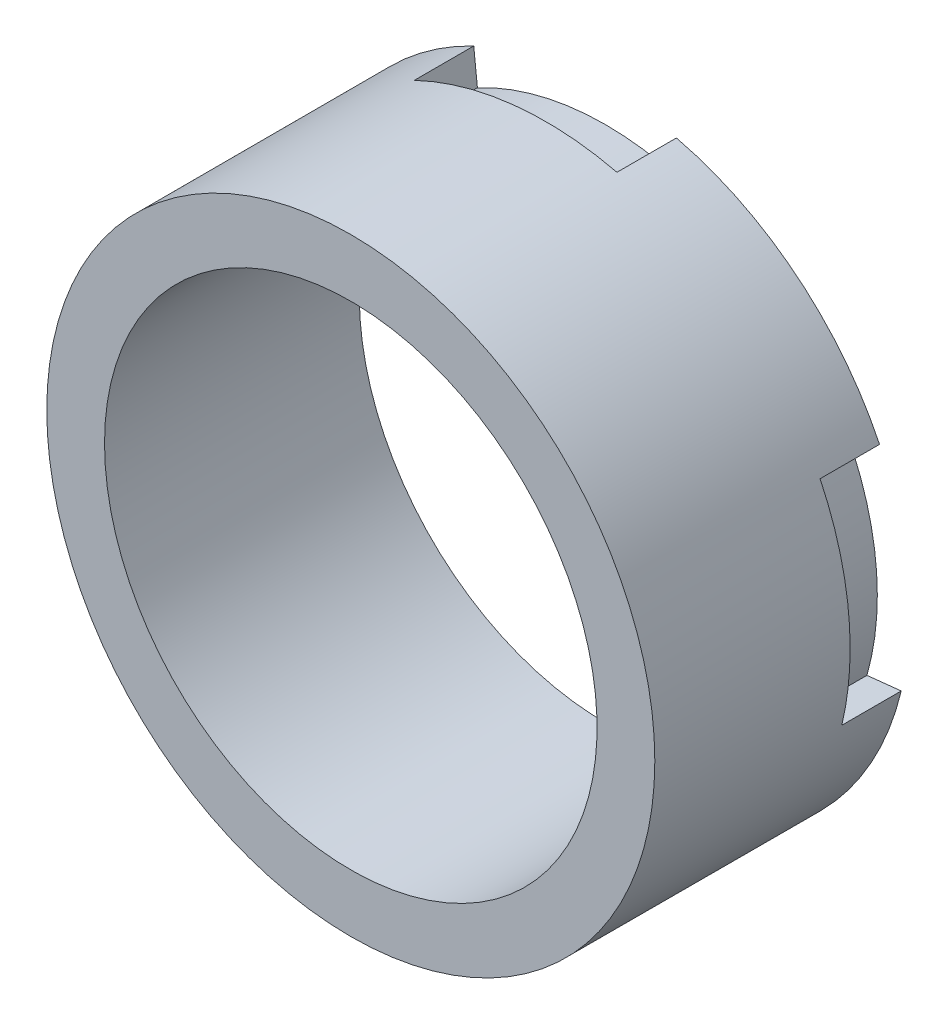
ISO-10303-21;
HEADER;
FILE_DESCRIPTION(('STEP AP214'),'2;1');
FILE_NAME('part.step','',(''),(''),'','','');
FILE_SCHEMA(('AUTOMOTIVE_DESIGN { 1 0 10303 214 1 1 1 1 }'));
ENDSEC;
DATA;
#1=APPLICATION_CONTEXT('core data for automotive mechanical design processes');
#2=APPLICATION_PROTOCOL_DEFINITION('international standard','automotive_design',2000,#1);
#3=PRODUCT_CONTEXT('',#1,'mechanical');
#4=PRODUCT('Part','Part','',(#3));
#5=PRODUCT_RELATED_PRODUCT_CATEGORY('part','',(#4));
#6=PRODUCT_DEFINITION_FORMATION('','',#4);
#7=PRODUCT_DEFINITION_CONTEXT('part definition',#1,'design');
#8=PRODUCT_DEFINITION('design','',#6,#7);
#9=PRODUCT_DEFINITION_SHAPE('','',#8);
#10=(LENGTH_UNIT() NAMED_UNIT(*) SI_UNIT(.MILLI.,.METRE.));
#11=(NAMED_UNIT(*) PLANE_ANGLE_UNIT() SI_UNIT($,.RADIAN.));
#12=(NAMED_UNIT(*) SI_UNIT($,.STERADIAN.) SOLID_ANGLE_UNIT());
#13=UNCERTAINTY_MEASURE_WITH_UNIT(LENGTH_MEASURE(1.E-05),#10,'distance_accuracy_value','');
#14=(GEOMETRIC_REPRESENTATION_CONTEXT(3) GLOBAL_UNCERTAINTY_ASSIGNED_CONTEXT((#13)) GLOBAL_UNIT_ASSIGNED_CONTEXT((#10,
#11,#12)) REPRESENTATION_CONTEXT('',''));
#15=CARTESIAN_POINT('',(0.,0.,0.));
#16=DIRECTION('',(0.,0.,1.));
#17=DIRECTION('',(1.,0.,0.));
#18=AXIS2_PLACEMENT_3D('',#15,#16,#17);
#19=CARTESIAN_POINT('',(7.05466076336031,3.77250069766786,9.3068197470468));
#20=DIRECTION('',(-0.106462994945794,0.994316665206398,0.));
#21=DIRECTION('',(-0.994316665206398,-0.106462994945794,0.));
#22=AXIS2_PLACEMENT_3D('',#19,#20,#21);
#23=PLANE('',#22);
#24=DIRECTION('',(0.,0.,1.));
#25=VECTOR('',#24,1.);
#26=CARTESIAN_POINT('',(8.06491766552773,3.88067043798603,7.5568197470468));
#27=LINE('',#26,#25);
#28=CARTESIAN_POINT('',(8.06491766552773,3.88067043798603,9.3068197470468));
#29=VERTEX_POINT('',#28);
#30=CARTESIAN_POINT('',(8.06491766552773,3.88067043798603,7.5568197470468));
#31=VERTEX_POINT('',#30);
#32=EDGE_CURVE('E158',#29,#31,#27,.F.);
#33=ORIENTED_EDGE('',*,*,#32,.F.);
#34=DIRECTION('',(-0.994316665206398,-0.106462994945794,0.));
#35=VECTOR('',#34,1.);
#36=CARTESIAN_POINT('',(7.05466076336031,3.77250069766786,9.3068197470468));
#37=LINE('',#36,#35);
#38=CARTESIAN_POINT('',(7.05466076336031,3.77250069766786,9.3068197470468));
#39=VERTEX_POINT('',#38);
#40=EDGE_CURVE('E165',#39,#29,#37,.F.);
#41=ORIENTED_EDGE('',*,*,#40,.F.);
#42=DIRECTION('',(0.,0.,-1.));
#43=VECTOR('',#42,1.);
#44=CARTESIAN_POINT('',(7.05466076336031,3.77250069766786,9.3068197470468));
#45=LINE('',#44,#43);
#46=CARTESIAN_POINT('',(7.05466076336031,3.77250069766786,7.5568197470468));
#47=VERTEX_POINT('',#46);
#48=EDGE_CURVE('E225',#47,#39,#45,.F.);
#49=ORIENTED_EDGE('',*,*,#48,.F.);
#50=DIRECTION('',(-0.994316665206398,-0.106462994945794,0.));
#51=VECTOR('',#50,1.);
#52=CARTESIAN_POINT('',(7.05466076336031,3.77250069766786,7.5568197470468));
#53=LINE('',#52,#51);
#54=EDGE_CURVE('E164',#31,#47,#53,.T.);
#55=ORIENTED_EDGE('',*,*,#54,.F.);
#56=EDGE_LOOP('',(#33,#41,#49,#55));
#57=FACE_BOUND('',#56,.T.);
#58=ADVANCED_FACE('F14',(#57),#23,.F.);
#59=CARTESIAN_POINT('',(2.19339929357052,7.69343873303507,9.3068197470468));
#60=DIRECTION('',(-0.994316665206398,-0.106462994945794,0.));
#61=DIRECTION('',(0.106462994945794,-0.994316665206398,0.));
#62=AXIS2_PLACEMENT_3D('',#59,#60,#61);
#63=PLANE('',#62);
#64=DIRECTION('',(0.106462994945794,-0.994316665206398,0.));
#65=VECTOR('',#64,1.);
#66=CARTESIAN_POINT('',(2.08522955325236,8.70369563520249,9.3068197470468));
#67=LINE('',#66,#65);
#68=CARTESIAN_POINT('',(2.08522955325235,8.70369563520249,9.3068197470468));
#69=VERTEX_POINT('',#68);
#70=CARTESIAN_POINT('',(2.19339929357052,7.69343873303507,9.3068197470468));
#71=VERTEX_POINT('',#70);
#72=EDGE_CURVE('E128',#69,#71,#67,.T.);
#73=ORIENTED_EDGE('',*,*,#72,.F.);
#74=DIRECTION('',(0.,0.,1.));
#75=VECTOR('',#74,1.);
#76=CARTESIAN_POINT('',(2.08522955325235,8.70369563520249,7.5568197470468));
#77=LINE('',#76,#75);
#78=CARTESIAN_POINT('',(2.08522955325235,8.70369563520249,7.5568197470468));
#79=VERTEX_POINT('',#78);
#80=EDGE_CURVE('E157',#79,#69,#77,.T.);
#81=ORIENTED_EDGE('',*,*,#80,.F.);
#82=DIRECTION('',(0.106462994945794,-0.994316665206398,0.));
#83=VECTOR('',#82,1.);
#84=CARTESIAN_POINT('',(2.19339929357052,7.69343873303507,7.5568197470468));
#85=LINE('',#84,#83);
#86=CARTESIAN_POINT('',(2.19339929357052,7.69343873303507,7.5568197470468));
#87=VERTEX_POINT('',#86);
#88=EDGE_CURVE('E139',#79,#87,#85,.T.);
#89=ORIENTED_EDGE('',*,*,#88,.T.);
#90=DIRECTION('',(0.,0.,-1.));
#91=VECTOR('',#90,1.);
#92=CARTESIAN_POINT('',(2.19339929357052,7.69343873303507,9.3068197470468));
#93=LINE('',#92,#91);
#94=EDGE_CURVE('E142',#71,#87,#93,.T.);
#95=ORIENTED_EDGE('',*,*,#94,.F.);
#96=EDGE_LOOP('',(#73,#81,#89,#95));
#97=FACE_BOUND('',#96,.T.);
#98=ADVANCED_FACE('F143',(#97),#63,.T.);
#99=CARTESIAN_POINT('',(0.,0.,9.3068197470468));
#100=DIRECTION('',(0.,0.,-1.));
#101=DIRECTION('',(-1.,0.,0.));
#102=AXIS2_PLACEMENT_3D('',#99,#100,#101);
#103=PLANE('',#102);
#104=CARTESIAN_POINT('',(0.,0.,9.3068197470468));
#105=DIRECTION('',(0.,0.,1.));
#106=DIRECTION('',(1.,0.,0.));
#107=AXIS2_PLACEMENT_3D('',#104,#105,#106);
#108=CIRCLE('',#107,8.95);
#109=CARTESIAN_POINT('',(-3.88067043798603,8.06491766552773,9.3068197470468));
#110=VERTEX_POINT('',#109);
#111=EDGE_CURVE('E134',#69,#110,#108,.T.);
#112=ORIENTED_EDGE('',*,*,#111,.F.);
#113=ORIENTED_EDGE('',*,*,#72,.T.);
#114=CARTESIAN_POINT('',(0.,0.,9.3068197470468));
#115=DIRECTION('',(0.,0.,-1.));
#116=DIRECTION('',(-1.,0.,0.));
#117=AXIS2_PLACEMENT_3D('',#114,#115,#116);
#118=CIRCLE('',#117,8.);
#119=CARTESIAN_POINT('',(-3.77250069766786,7.05466076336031,9.3068197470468));
#120=VERTEX_POINT('',#119);
#121=EDGE_CURVE('E17',#120,#71,#118,.T.);
#122=ORIENTED_EDGE('',*,*,#121,.F.);
#123=DIRECTION('',(-0.106462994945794,0.994316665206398,0.));
#124=VECTOR('',#123,1.);
#125=CARTESIAN_POINT('',(-3.77250069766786,7.05466076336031,9.3068197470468));
#126=LINE('',#125,#124);
#127=EDGE_CURVE('E123',#110,#120,#126,.F.);
#128=ORIENTED_EDGE('',*,*,#127,.F.);
#129=EDGE_LOOP('',(#112,#113,#122,#128));
#130=FACE_BOUND('',#129,.T.);
#131=ADVANCED_FACE('F130',(#130),#103,.T.);
#132=CARTESIAN_POINT('',(-3.77250069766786,7.05466076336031,9.3068197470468));
#133=DIRECTION('',(0.994316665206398,0.106462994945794,0.));
#134=DIRECTION('',(-0.106462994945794,0.994316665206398,0.));
#135=AXIS2_PLACEMENT_3D('',#132,#133,#134);
#136=PLANE('',#135);
#137=ORIENTED_EDGE('',*,*,#127,.T.);
#138=DIRECTION('',(0.,0.,-1.));
#139=VECTOR('',#138,1.);
#140=CARTESIAN_POINT('',(-3.77250069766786,7.05466076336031,9.3068197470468));
#141=LINE('',#140,#139);
#142=CARTESIAN_POINT('',(-3.77250069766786,7.05466076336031,7.5568197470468));
#143=VERTEX_POINT('',#142);
#144=EDGE_CURVE('E150',#143,#120,#141,.F.);
#145=ORIENTED_EDGE('',*,*,#144,.F.);
#146=DIRECTION('',(-0.106462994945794,0.994316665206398,0.));
#147=VECTOR('',#146,1.);
#148=CARTESIAN_POINT('',(-3.77250069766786,7.05466076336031,7.5568197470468));
#149=LINE('',#148,#147);
#150=CARTESIAN_POINT('',(-3.88067043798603,8.06491766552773,7.5568197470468));
#151=VERTEX_POINT('',#150);
#152=EDGE_CURVE('E138',#143,#151,#149,.T.);
#153=ORIENTED_EDGE('',*,*,#152,.T.);
#154=DIRECTION('',(0.,0.,1.));
#155=VECTOR('',#154,1.);
#156=CARTESIAN_POINT('',(-3.88067043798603,8.06491766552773,7.5568197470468));
#157=LINE('',#156,#155);
#158=EDGE_CURVE('E222',#110,#151,#157,.F.);
#159=ORIENTED_EDGE('',*,*,#158,.F.);
#160=EDGE_LOOP('',(#137,#145,#153,#159));
#161=FACE_BOUND('',#160,.T.);
#162=ADVANCED_FACE('F487',(#161),#136,.T.);
#163=CARTESIAN_POINT('',(-8.70369563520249,2.08522955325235,9.3068197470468));
#164=DIRECTION('',(-0.106462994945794,0.994316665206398,0.));
#165=DIRECTION('',(-0.994316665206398,-0.106462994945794,0.));
#166=AXIS2_PLACEMENT_3D('',#163,#164,#165);
#167=PLANE('',#166);
#168=DIRECTION('',(0.,0.,-1.));
#169=VECTOR('',#168,1.);
#170=CARTESIAN_POINT('',(-7.69343873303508,2.19339929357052,9.3068197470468));
#171=LINE('',#170,#169);
#172=CARTESIAN_POINT('',(-7.69343873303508,2.19339929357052,9.3068197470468));
#173=VERTEX_POINT('',#172);
#174=CARTESIAN_POINT('',(-7.69343873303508,2.19339929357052,7.5568197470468));
#175=VERTEX_POINT('',#174);
#176=EDGE_CURVE('E147',#173,#175,#171,.T.);
#177=ORIENTED_EDGE('',*,*,#176,.F.);
#178=DIRECTION('',(-0.994316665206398,-0.106462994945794,0.));
#179=VECTOR('',#178,1.);
#180=CARTESIAN_POINT('',(-8.70369563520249,2.08522955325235,9.3068197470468));
#181=LINE('',#180,#179);
#182=CARTESIAN_POINT('',(-8.7036956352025,2.08522955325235,9.3068197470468));
#183=VERTEX_POINT('',#182);
#184=EDGE_CURVE('E153',#183,#173,#181,.F.);
#185=ORIENTED_EDGE('',*,*,#184,.F.);
#186=DIRECTION('',(0.,0.,1.));
#187=VECTOR('',#186,1.);
#188=CARTESIAN_POINT('',(-8.7036956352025,2.08522955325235,7.5568197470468));
#189=LINE('',#188,#187);
#190=CARTESIAN_POINT('',(-8.7036956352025,2.08522955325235,7.5568197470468));
#191=VERTEX_POINT('',#190);
#192=EDGE_CURVE('E221',#191,#183,#189,.T.);
#193=ORIENTED_EDGE('',*,*,#192,.F.);
#194=DIRECTION('',(-0.994316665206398,-0.106462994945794,0.));
#195=VECTOR('',#194,1.);
#196=CARTESIAN_POINT('',(-8.70369563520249,2.08522955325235,7.5568197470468));
#197=LINE('',#196,#195);
#198=EDGE_CURVE('E151',#175,#191,#197,.T.);
#199=ORIENTED_EDGE('',*,*,#198,.F.);
#200=EDGE_LOOP('',(#177,#185,#193,#199));
#201=FACE_BOUND('',#200,.T.);
#202=ADVANCED_FACE('F260',(#201),#167,.F.);
#203=CARTESIAN_POINT('',(0.,0.,9.3068197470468));
#204=DIRECTION('',(0.,0.,-1.));
#205=DIRECTION('',(-1.,0.,0.));
#206=AXIS2_PLACEMENT_3D('',#203,#204,#205);
#207=CYLINDRICAL_SURFACE('',#206,8.);
#208=ORIENTED_EDGE('',*,*,#121,.T.);
#209=ORIENTED_EDGE('',*,*,#94,.T.);
#210=CARTESIAN_POINT('',(0.,0.,7.5568197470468));
#211=DIRECTION('',(0.,0.,-1.));
#212=DIRECTION('',(-1.,0.,0.));
#213=AXIS2_PLACEMENT_3D('',#210,#211,#212);
#214=CIRCLE('',#213,8.);
#215=EDGE_CURVE('E204',#87,#143,#214,.F.);
#216=ORIENTED_EDGE('',*,*,#215,.T.);
#217=ORIENTED_EDGE('',*,*,#144,.T.);
#218=EDGE_LOOP('',(#208,#209,#216,#217));
#219=FACE_BOUND('',#218,.T.);
#220=ADVANCED_FACE('F149',(#219),#207,.T.);
#221=CARTESIAN_POINT('',(0.,0.,9.3068197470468));
#222=DIRECTION('',(0.,0.,-1.));
#223=DIRECTION('',(-1.,0.,0.));
#224=AXIS2_PLACEMENT_3D('',#221,#222,#223);
#225=CYLINDRICAL_SURFACE('',#224,8.);
#226=CARTESIAN_POINT('',(0.,0.,9.3068197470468));
#227=DIRECTION('',(0.,0.,-1.));
#228=DIRECTION('',(-1.,0.,0.));
#229=AXIS2_PLACEMENT_3D('',#226,#227,#228);
#230=CIRCLE('',#229,8.);
#231=CARTESIAN_POINT('',(-7.05466076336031,-3.77250069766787,9.3068197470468));
#232=VERTEX_POINT('',#231);
#233=EDGE_CURVE('E217',#232,#173,#230,.T.);
#234=ORIENTED_EDGE('',*,*,#233,.T.);
#235=ORIENTED_EDGE('',*,*,#176,.T.);
#236=CARTESIAN_POINT('',(0.,0.,7.5568197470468));
#237=DIRECTION('',(0.,0.,-1.));
#238=DIRECTION('',(-1.,0.,0.));
#239=AXIS2_PLACEMENT_3D('',#236,#237,#238);
#240=CIRCLE('',#239,8.);
#241=CARTESIAN_POINT('',(-7.05466076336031,-3.77250069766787,7.5568197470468));
#242=VERTEX_POINT('',#241);
#243=EDGE_CURVE('E198',#175,#242,#240,.F.);
#244=ORIENTED_EDGE('',*,*,#243,.T.);
#245=DIRECTION('',(0.,0.,1.));
#246=VECTOR('',#245,1.);
#247=CARTESIAN_POINT('',(-7.05466076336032,-3.77250069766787,9.3068197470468));
#248=LINE('',#247,#246);
#249=EDGE_CURVE('E220',#242,#232,#248,.T.);
#250=ORIENTED_EDGE('',*,*,#249,.T.);
#251=EDGE_LOOP('',(#234,#235,#244,#250));
#252=FACE_BOUND('',#251,.T.);
#253=ADVANCED_FACE('F460',(#252),#225,.T.);
#254=CARTESIAN_POINT('',(0.,0.,9.3068197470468));
#255=DIRECTION('',(0.,0.,-1.));
#256=DIRECTION('',(-1.,0.,0.));
#257=AXIS2_PLACEMENT_3D('',#254,#255,#256);
#258=CYLINDRICAL_SURFACE('',#257,8.);
#259=CARTESIAN_POINT('',(0.,0.,9.3068197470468));
#260=DIRECTION('',(0.,0.,-1.));
#261=DIRECTION('',(-1.,0.,0.));
#262=AXIS2_PLACEMENT_3D('',#259,#260,#261);
#263=CIRCLE('',#262,8.);
#264=CARTESIAN_POINT('',(3.77250069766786,-7.05466076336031,9.3068197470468));
#265=VERTEX_POINT('',#264);
#266=CARTESIAN_POINT('',(-2.19339929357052,-7.69343873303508,9.3068197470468));
#267=VERTEX_POINT('',#266);
#268=EDGE_CURVE('E213',#265,#267,#263,.T.);
#269=ORIENTED_EDGE('',*,*,#268,.T.);
#270=DIRECTION('',(0.,0.,1.));
#271=VECTOR('',#270,1.);
#272=CARTESIAN_POINT('',(-2.19339929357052,-7.69343873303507,9.3068197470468));
#273=LINE('',#272,#271);
#274=CARTESIAN_POINT('',(-2.19339929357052,-7.69343873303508,7.5568197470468));
#275=VERTEX_POINT('',#274);
#276=EDGE_CURVE('E216',#275,#267,#273,.T.);
#277=ORIENTED_EDGE('',*,*,#276,.F.);
#278=CARTESIAN_POINT('',(0.,0.,7.5568197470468));
#279=DIRECTION('',(0.,0.,-1.));
#280=DIRECTION('',(-1.,0.,0.));
#281=AXIS2_PLACEMENT_3D('',#278,#279,#280);
#282=CIRCLE('',#281,8.);
#283=CARTESIAN_POINT('',(3.77250069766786,-7.05466076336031,7.5568197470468));
#284=VERTEX_POINT('',#283);
#285=EDGE_CURVE('E195',#275,#284,#282,.F.);
#286=ORIENTED_EDGE('',*,*,#285,.T.);
#287=DIRECTION('',(0.,0.,1.));
#288=VECTOR('',#287,1.);
#289=CARTESIAN_POINT('',(3.77250069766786,-7.05466076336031,9.3068197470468));
#290=LINE('',#289,#288);
#291=EDGE_CURVE('E212',#265,#284,#290,.F.);
#292=ORIENTED_EDGE('',*,*,#291,.F.);
#293=EDGE_LOOP('',(#269,#277,#286,#292));
#294=FACE_BOUND('',#293,.T.);
#295=ADVANCED_FACE('F308',(#294),#258,.T.);
#296=CARTESIAN_POINT('',(0.,0.,33.9589029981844));
#297=DIRECTION('',(0.,0.,-1.));
#298=DIRECTION('',(-1.,0.,0.));
#299=AXIS2_PLACEMENT_3D('',#296,#297,#298);
#300=CYLINDRICAL_SURFACE('',#299,7.25);
#301=CARTESIAN_POINT('',(0.,0.,7.5568197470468));
#302=DIRECTION('',(0.,0.,-1.));
#303=DIRECTION('',(-1.,0.,0.));
#304=AXIS2_PLACEMENT_3D('',#301,#302,#303);
#305=CIRCLE('',#304,7.25);
#306=CARTESIAN_POINT('',(-7.25,0.,7.5568197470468));
#307=VERTEX_POINT('',#306);
#308=EDGE_CURVE('E190',#307,#307,#305,.T.);
#309=ORIENTED_EDGE('',*,*,#308,.T.);
#310=EDGE_LOOP('',(#309));
#311=FACE_BOUND('',#310,.T.);
#312=CARTESIAN_POINT('',(0.,0.,15.0568197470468));
#313=DIRECTION('',(0.,0.,-1.));
#314=DIRECTION('',(-1.,0.,0.));
#315=AXIS2_PLACEMENT_3D('',#312,#313,#314);
#316=CIRCLE('',#315,7.25);
#317=CARTESIAN_POINT('',(-7.25,0.,15.0568197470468));
#318=VERTEX_POINT('',#317);
#319=EDGE_CURVE('E223',#318,#318,#316,.T.);
#320=ORIENTED_EDGE('',*,*,#319,.F.);
#321=EDGE_LOOP('',(#320));
#322=FACE_BOUND('',#321,.T.);
#323=ADVANCED_FACE('F300',(#311,#322),#300,.F.);
#324=CARTESIAN_POINT('',(0.,0.,9.3068197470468));
#325=DIRECTION('',(0.,0.,-1.));
#326=DIRECTION('',(-1.,0.,0.));
#327=AXIS2_PLACEMENT_3D('',#324,#325,#326);
#328=CYLINDRICAL_SURFACE('',#327,8.);
#329=CARTESIAN_POINT('',(0.,0.,9.3068197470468));
#330=DIRECTION('',(0.,0.,-1.));
#331=DIRECTION('',(-1.,0.,0.));
#332=AXIS2_PLACEMENT_3D('',#329,#330,#331);
#333=CIRCLE('',#332,8.);
#334=CARTESIAN_POINT('',(7.69343873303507,-2.19339929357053,9.3068197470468));
#335=VERTEX_POINT('',#334);
#336=EDGE_CURVE('E187',#335,#39,#333,.F.);
#337=ORIENTED_EDGE('',*,*,#336,.F.);
#338=DIRECTION('',(0.,0.,1.));
#339=VECTOR('',#338,1.);
#340=CARTESIAN_POINT('',(7.69343873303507,-2.19339929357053,9.3068197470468));
#341=LINE('',#340,#339);
#342=CARTESIAN_POINT('',(7.69343873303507,-2.19339929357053,7.5568197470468));
#343=VERTEX_POINT('',#342);
#344=EDGE_CURVE('E193',#335,#343,#341,.F.);
#345=ORIENTED_EDGE('',*,*,#344,.T.);
#346=CARTESIAN_POINT('',(0.,0.,7.5568197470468));
#347=DIRECTION('',(0.,0.,-1.));
#348=DIRECTION('',(-1.,0.,0.));
#349=AXIS2_PLACEMENT_3D('',#346,#347,#348);
#350=CIRCLE('',#349,8.);
#351=EDGE_CURVE('E209',#343,#47,#350,.F.);
#352=ORIENTED_EDGE('',*,*,#351,.T.);
#353=ORIENTED_EDGE('',*,*,#48,.T.);
#354=EDGE_LOOP('',(#337,#345,#352,#353));
#355=FACE_BOUND('',#354,.T.);
#356=ADVANCED_FACE('F297',(#355),#328,.T.);
#357=CARTESIAN_POINT('',(0.,0.,15.0568197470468));
#358=DIRECTION('',(0.,0.,1.));
#359=DIRECTION('',(0.,-1.,0.));
#360=AXIS2_PLACEMENT_3D('',#357,#358,#359);
#361=PLANE('',#360);
#362=ORIENTED_EDGE('',*,*,#319,.T.);
#363=EDGE_LOOP('',(#362));
#364=FACE_BOUND('',#363,.T.);
#365=CARTESIAN_POINT('',(0.,0.,15.0568197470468));
#366=DIRECTION('',(0.,0.,1.));
#367=DIRECTION('',(1.,0.,0.));
#368=AXIS2_PLACEMENT_3D('',#365,#366,#367);
#369=CIRCLE('',#368,8.95);
#370=CARTESIAN_POINT('',(8.95,0.,15.0568197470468));
#371=VERTEX_POINT('',#370);
#372=EDGE_CURVE('E184',#371,#371,#369,.F.);
#373=ORIENTED_EDGE('',*,*,#372,.F.);
#374=EDGE_LOOP('',(#373));
#375=FACE_BOUND('',#374,.T.);
#376=ADVANCED_FACE('F299',(#364,#375),#361,.T.);
#377=CARTESIAN_POINT('',(0.,0.,9.3068197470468));
#378=DIRECTION('',(0.,0.,1.));
#379=DIRECTION('',(0.,-1.,0.));
#380=AXIS2_PLACEMENT_3D('',#377,#378,#379);
#381=PLANE('',#380);
#382=DIRECTION('',(0.994316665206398,0.106462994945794,0.));
#383=VECTOR('',#382,1.);
#384=CARTESIAN_POINT('',(-7.05466076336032,-3.77250069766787,9.3068197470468));
#385=LINE('',#384,#383);
#386=CARTESIAN_POINT('',(-8.06491766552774,-3.88067043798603,9.3068197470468));
#387=VERTEX_POINT('',#386);
#388=EDGE_CURVE('E239',#232,#387,#385,.F.);
#389=ORIENTED_EDGE('',*,*,#388,.T.);
#390=CARTESIAN_POINT('',(0.,0.,9.3068197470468));
#391=DIRECTION('',(0.,0.,1.));
#392=DIRECTION('',(1.,0.,0.));
#393=AXIS2_PLACEMENT_3D('',#390,#391,#392);
#394=CIRCLE('',#393,8.95);
#395=EDGE_CURVE('E181',#183,#387,#394,.T.);
#396=ORIENTED_EDGE('',*,*,#395,.F.);
#397=ORIENTED_EDGE('',*,*,#184,.T.);
#398=ORIENTED_EDGE('',*,*,#233,.F.);
#399=EDGE_LOOP('',(#389,#396,#397,#398));
#400=FACE_BOUND('',#399,.T.);
#401=ADVANCED_FACE('F263',(#400),#381,.F.);
#402=CARTESIAN_POINT('',(-7.05466076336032,-3.77250069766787,9.3068197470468));
#403=DIRECTION('',(0.106462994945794,-0.994316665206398,0.));
#404=DIRECTION('',(0.994316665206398,0.106462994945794,0.));
#405=AXIS2_PLACEMENT_3D('',#402,#403,#404);
#406=PLANE('',#405);
#407=DIRECTION('',(0.,0.,1.));
#408=VECTOR('',#407,1.);
#409=CARTESIAN_POINT('',(-8.06491766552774,-3.88067043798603,7.5568197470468));
#410=LINE('',#409,#408);
#411=CARTESIAN_POINT('',(-8.06491766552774,-3.88067043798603,7.5568197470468));
#412=VERTEX_POINT('',#411);
#413=EDGE_CURVE('E180',#387,#412,#410,.F.);
#414=ORIENTED_EDGE('',*,*,#413,.F.);
#415=ORIENTED_EDGE('',*,*,#388,.F.);
#416=ORIENTED_EDGE('',*,*,#249,.F.);
#417=DIRECTION('',(-0.994316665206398,-0.106462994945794,0.));
#418=VECTOR('',#417,1.);
#419=CARTESIAN_POINT('',(-7.05466076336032,-3.77250069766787,7.5568197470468));
#420=LINE('',#419,#418);
#421=EDGE_CURVE('E200',#242,#412,#420,.T.);
#422=ORIENTED_EDGE('',*,*,#421,.T.);
#423=EDGE_LOOP('',(#414,#415,#416,#422));
#424=FACE_BOUND('',#423,.T.);
#425=ADVANCED_FACE('F268',(#424),#406,.F.);
#426=CARTESIAN_POINT('',(-2.08522955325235,-8.7036956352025,9.3068197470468));
#427=DIRECTION('',(0.994316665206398,0.106462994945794,0.));
#428=DIRECTION('',(-0.106462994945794,0.994316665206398,0.));
#429=AXIS2_PLACEMENT_3D('',#426,#427,#428);
#430=PLANE('',#429);
#431=DIRECTION('',(0.106462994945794,-0.994316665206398,0.));
#432=VECTOR('',#431,1.);
#433=CARTESIAN_POINT('',(-2.19339929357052,-7.69343873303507,9.3068197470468));
#434=LINE('',#433,#432);
#435=CARTESIAN_POINT('',(-2.08522955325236,-8.7036956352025,9.3068197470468));
#436=VERTEX_POINT('',#435);
#437=EDGE_CURVE('E215',#267,#436,#434,.T.);
#438=ORIENTED_EDGE('',*,*,#437,.T.);
#439=DIRECTION('',(0.,0.,1.));
#440=VECTOR('',#439,1.);
#441=CARTESIAN_POINT('',(-2.08522955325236,-8.7036956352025,7.5568197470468));
#442=LINE('',#441,#440);
#443=CARTESIAN_POINT('',(-2.08522955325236,-8.7036956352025,7.5568197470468));
#444=VERTEX_POINT('',#443);
#445=EDGE_CURVE('E176',#444,#436,#442,.T.);
#446=ORIENTED_EDGE('',*,*,#445,.F.);
#447=DIRECTION('',(-0.106462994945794,0.994316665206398,0.));
#448=VECTOR('',#447,1.);
#449=CARTESIAN_POINT('',(-2.08522955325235,-8.7036956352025,7.5568197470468));
#450=LINE('',#449,#448);
#451=EDGE_CURVE('E197',#444,#275,#450,.T.);
#452=ORIENTED_EDGE('',*,*,#451,.T.);
#453=ORIENTED_EDGE('',*,*,#276,.T.);
#454=EDGE_LOOP('',(#438,#446,#452,#453));
#455=FACE_BOUND('',#454,.T.);
#456=ADVANCED_FACE('F331',(#455),#430,.T.);
#457=CARTESIAN_POINT('',(0.,0.,9.3068197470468));
#458=DIRECTION('',(0.,0.,1.));
#459=DIRECTION('',(0.,-1.,0.));
#460=AXIS2_PLACEMENT_3D('',#457,#458,#459);
#461=PLANE('',#460);
#462=ORIENTED_EDGE('',*,*,#437,.F.);
#463=ORIENTED_EDGE('',*,*,#268,.F.);
#464=DIRECTION('',(0.106462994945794,-0.994316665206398,0.));
#465=VECTOR('',#464,1.);
#466=CARTESIAN_POINT('',(3.88067043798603,-8.06491766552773,9.3068197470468));
#467=LINE('',#466,#465);
#468=CARTESIAN_POINT('',(3.88067043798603,-8.06491766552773,9.3068197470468));
#469=VERTEX_POINT('',#468);
#470=EDGE_CURVE('E245',#469,#265,#467,.F.);
#471=ORIENTED_EDGE('',*,*,#470,.F.);
#472=CARTESIAN_POINT('',(0.,0.,9.3068197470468));
#473=DIRECTION('',(0.,0.,1.));
#474=DIRECTION('',(1.,0.,0.));
#475=AXIS2_PLACEMENT_3D('',#472,#473,#474);
#476=CIRCLE('',#475,8.95);
#477=EDGE_CURVE('E173',#436,#469,#476,.T.);
#478=ORIENTED_EDGE('',*,*,#477,.F.);
#479=EDGE_LOOP('',(#462,#463,#471,#478));
#480=FACE_BOUND('',#479,.T.);
#481=ADVANCED_FACE('F327',(#480),#461,.F.);
#482=CARTESIAN_POINT('',(3.88067043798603,-8.06491766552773,9.3068197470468));
#483=DIRECTION('',(-0.994316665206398,-0.106462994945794,0.));
#484=DIRECTION('',(0.106462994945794,-0.994316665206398,0.));
#485=AXIS2_PLACEMENT_3D('',#482,#483,#484);
#486=PLANE('',#485);
#487=ORIENTED_EDGE('',*,*,#470,.T.);
#488=ORIENTED_EDGE('',*,*,#291,.T.);
#489=DIRECTION('',(0.106462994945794,-0.994316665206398,0.));
#490=VECTOR('',#489,1.);
#491=CARTESIAN_POINT('',(3.77250069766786,-7.05466076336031,7.5568197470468));
#492=LINE('',#491,#490);
#493=CARTESIAN_POINT('',(3.88067043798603,-8.06491766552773,7.5568197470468));
#494=VERTEX_POINT('',#493);
#495=EDGE_CURVE('E194',#284,#494,#492,.T.);
#496=ORIENTED_EDGE('',*,*,#495,.T.);
#497=DIRECTION('',(0.,0.,1.));
#498=VECTOR('',#497,1.);
#499=CARTESIAN_POINT('',(3.88067043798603,-8.06491766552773,7.5568197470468));
#500=LINE('',#499,#498);
#501=EDGE_CURVE('E172',#469,#494,#500,.F.);
#502=ORIENTED_EDGE('',*,*,#501,.F.);
#503=EDGE_LOOP('',(#487,#488,#496,#502));
#504=FACE_BOUND('',#503,.T.);
#505=ADVANCED_FACE('F323',(#504),#486,.T.);
#506=CARTESIAN_POINT('',(0.,0.,7.5568197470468));
#507=DIRECTION('',(0.,0.,1.));
#508=DIRECTION('',(0.,-1.,0.));
#509=AXIS2_PLACEMENT_3D('',#506,#507,#508);
#510=PLANE('',#509);
#511=ORIENTED_EDGE('',*,*,#308,.F.);
#512=EDGE_LOOP('',(#511));
#513=FACE_BOUND('',#512,.T.);
#514=ORIENTED_EDGE('',*,*,#285,.F.);
#515=ORIENTED_EDGE('',*,*,#451,.F.);
#516=CARTESIAN_POINT('',(0.,0.,7.5568197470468));
#517=DIRECTION('',(0.,0.,1.));
#518=DIRECTION('',(1.,0.,0.));
#519=AXIS2_PLACEMENT_3D('',#516,#517,#518);
#520=CIRCLE('',#519,8.95);
#521=EDGE_CURVE('E177',#412,#444,#520,.T.);
#522=ORIENTED_EDGE('',*,*,#521,.F.);
#523=ORIENTED_EDGE('',*,*,#421,.F.);
#524=ORIENTED_EDGE('',*,*,#243,.F.);
#525=ORIENTED_EDGE('',*,*,#198,.T.);
#526=CARTESIAN_POINT('',(0.,0.,7.5568197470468));
#527=DIRECTION('',(0.,0.,1.));
#528=DIRECTION('',(1.,0.,0.));
#529=AXIS2_PLACEMENT_3D('',#526,#527,#528);
#530=CIRCLE('',#529,8.95);
#531=EDGE_CURVE('E201',#151,#191,#530,.T.);
#532=ORIENTED_EDGE('',*,*,#531,.F.);
#533=ORIENTED_EDGE('',*,*,#152,.F.);
#534=ORIENTED_EDGE('',*,*,#215,.F.);
#535=ORIENTED_EDGE('',*,*,#88,.F.);
#536=CARTESIAN_POINT('',(0.,0.,7.5568197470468));
#537=DIRECTION('',(0.,0.,1.));
#538=DIRECTION('',(1.,0.,0.));
#539=AXIS2_PLACEMENT_3D('',#536,#537,#538);
#540=CIRCLE('',#539,8.95);
#541=EDGE_CURVE('E206',#31,#79,#540,.T.);
#542=ORIENTED_EDGE('',*,*,#541,.F.);
#543=ORIENTED_EDGE('',*,*,#54,.T.);
#544=ORIENTED_EDGE('',*,*,#351,.F.);
#545=DIRECTION('',(0.994316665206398,0.106462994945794,0.));
#546=VECTOR('',#545,1.);
#547=CARTESIAN_POINT('',(8.7036956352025,-2.08522955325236,7.5568197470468));
#548=LINE('',#547,#546);
#549=CARTESIAN_POINT('',(8.70369563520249,-2.08522955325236,7.5568197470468));
#550=VERTEX_POINT('',#549);
#551=EDGE_CURVE('E241',#343,#550,#548,.T.);
#552=ORIENTED_EDGE('',*,*,#551,.T.);
#553=CARTESIAN_POINT('',(0.,0.,7.5568197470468));
#554=DIRECTION('',(0.,0.,1.));
#555=DIRECTION('',(1.,0.,0.));
#556=AXIS2_PLACEMENT_3D('',#553,#554,#555);
#557=CIRCLE('',#556,8.95);
#558=EDGE_CURVE('E169',#494,#550,#557,.T.);
#559=ORIENTED_EDGE('',*,*,#558,.F.);
#560=ORIENTED_EDGE('',*,*,#495,.F.);
#561=EDGE_LOOP('',(#514,#515,#522,#523,#524,#525,#532,#533,#534,#535,#542,#543,#544,#552,#559,#560));
#562=FACE_BOUND('',#561,.T.);
#563=ADVANCED_FACE('F294',(#513,#562),#510,.F.);
#564=CARTESIAN_POINT('',(8.7036956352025,-2.08522955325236,9.3068197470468));
#565=DIRECTION('',(0.106462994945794,-0.994316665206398,0.));
#566=DIRECTION('',(0.994316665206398,0.106462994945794,0.));
#567=AXIS2_PLACEMENT_3D('',#564,#565,#566);
#568=PLANE('',#567);
#569=ORIENTED_EDGE('',*,*,#344,.F.);
#570=DIRECTION('',(-0.994316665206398,-0.106462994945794,0.));
#571=VECTOR('',#570,1.);
#572=CARTESIAN_POINT('',(8.7036956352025,-2.08522955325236,9.3068197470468));
#573=LINE('',#572,#571);
#574=CARTESIAN_POINT('',(8.70369563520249,-2.08522955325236,9.3068197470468));
#575=VERTEX_POINT('',#574);
#576=EDGE_CURVE('E32',#575,#335,#573,.T.);
#577=ORIENTED_EDGE('',*,*,#576,.F.);
#578=DIRECTION('',(0.,0.,1.));
#579=VECTOR('',#578,1.);
#580=CARTESIAN_POINT('',(8.70369563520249,-2.08522955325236,7.5568197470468));
#581=LINE('',#580,#579);
#582=EDGE_CURVE('E23',#550,#575,#581,.T.);
#583=ORIENTED_EDGE('',*,*,#582,.F.);
#584=ORIENTED_EDGE('',*,*,#551,.F.);
#585=EDGE_LOOP('',(#569,#577,#583,#584));
#586=FACE_BOUND('',#585,.T.);
#587=ADVANCED_FACE('F290',(#586),#568,.F.);
#588=CARTESIAN_POINT('',(0.,0.,9.3068197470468));
#589=DIRECTION('',(0.,0.,-1.));
#590=DIRECTION('',(-1.,0.,0.));
#591=AXIS2_PLACEMENT_3D('',#588,#589,#590);
#592=PLANE('',#591);
#593=ORIENTED_EDGE('',*,*,#336,.T.);
#594=ORIENTED_EDGE('',*,*,#40,.T.);
#595=CARTESIAN_POINT('',(0.,0.,9.3068197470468));
#596=DIRECTION('',(0.,0.,1.));
#597=DIRECTION('',(1.,0.,0.));
#598=AXIS2_PLACEMENT_3D('',#595,#596,#597);
#599=CIRCLE('',#598,8.95);
#600=EDGE_CURVE('E9',#575,#29,#599,.T.);
#601=ORIENTED_EDGE('',*,*,#600,.F.);
#602=ORIENTED_EDGE('',*,*,#576,.T.);
#603=EDGE_LOOP('',(#593,#594,#601,#602));
#604=FACE_BOUND('',#603,.T.);
#605=ADVANCED_FACE('F286',(#604),#592,.T.);
#606=CARTESIAN_POINT('',(0.,0.,7.5568197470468));
#607=DIRECTION('',(0.,0.,1.));
#608=DIRECTION('',(1.,0.,0.));
#609=AXIS2_PLACEMENT_3D('',#606,#607,#608);
#610=CYLINDRICAL_SURFACE('',#609,8.95);
#611=ORIENTED_EDGE('',*,*,#372,.T.);
#612=EDGE_LOOP('',(#611));
#613=FACE_BOUND('',#612,.T.);
#614=ORIENTED_EDGE('',*,*,#582,.T.);
#615=ORIENTED_EDGE('',*,*,#600,.T.);
#616=ORIENTED_EDGE('',*,*,#32,.T.);
#617=ORIENTED_EDGE('',*,*,#541,.T.);
#618=ORIENTED_EDGE('',*,*,#80,.T.);
#619=ORIENTED_EDGE('',*,*,#111,.T.);
#620=ORIENTED_EDGE('',*,*,#158,.T.);
#621=ORIENTED_EDGE('',*,*,#531,.T.);
#622=ORIENTED_EDGE('',*,*,#192,.T.);
#623=ORIENTED_EDGE('',*,*,#395,.T.);
#624=ORIENTED_EDGE('',*,*,#413,.T.);
#625=ORIENTED_EDGE('',*,*,#521,.T.);
#626=ORIENTED_EDGE('',*,*,#445,.T.);
#627=ORIENTED_EDGE('',*,*,#477,.T.);
#628=ORIENTED_EDGE('',*,*,#501,.T.);
#629=ORIENTED_EDGE('',*,*,#558,.T.);
#630=EDGE_LOOP('',(#614,#615,#616,#617,#618,#619,#620,#621,#622,#623,#624,#625,#626,#627,#628,#629));
#631=FACE_BOUND('',#630,.T.);
#632=ADVANCED_FACE('F254',(#613,#631),#610,.T.);
#633=CLOSED_SHELL('',(#58,#98,#131,#162,#202,#220,#253,#295,#323,#356,#376,#401,#425,#456,#481,
#505,#563,#587,#605,#632));
#634=MANIFOLD_SOLID_BREP('B1',#633);
#635=ADVANCED_BREP_SHAPE_REPRESENTATION('',(#18,#634),#14);
#636=SHAPE_DEFINITION_REPRESENTATION(#9,#635);
ENDSEC;
END-ISO-10303-21;
